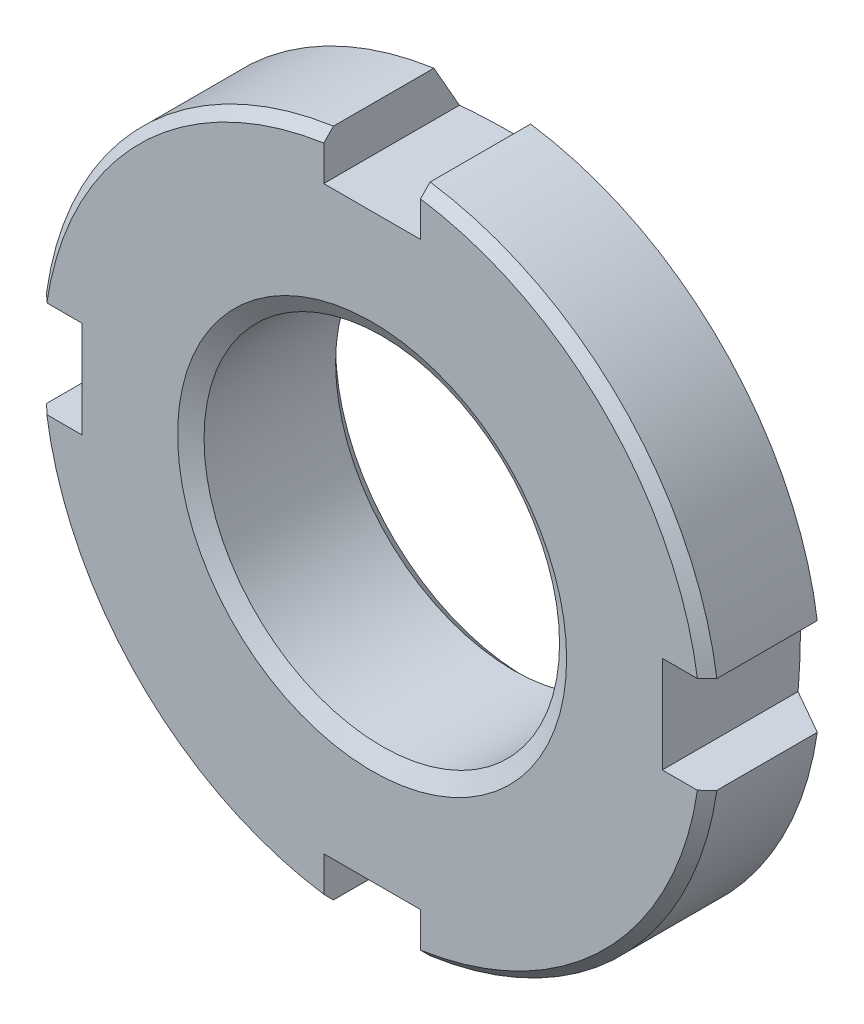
ISO-10303-21;
HEADER;
FILE_DESCRIPTION(('STEP AP214'),'2;1');
FILE_NAME('part.step','',(''),(''),'','','');
FILE_SCHEMA(('AUTOMOTIVE_DESIGN { 1 0 10303 214 1 1 1 1 }'));
ENDSEC;
DATA;
#1=APPLICATION_CONTEXT('core data for automotive mechanical design processes');
#2=APPLICATION_PROTOCOL_DEFINITION('international standard','automotive_design',2000,#1);
#3=PRODUCT_CONTEXT('',#1,'mechanical');
#4=PRODUCT('Part','Part','',(#3));
#5=PRODUCT_RELATED_PRODUCT_CATEGORY('part','',(#4));
#6=PRODUCT_DEFINITION_FORMATION('','',#4);
#7=PRODUCT_DEFINITION_CONTEXT('part definition',#1,'design');
#8=PRODUCT_DEFINITION('design','',#6,#7);
#9=PRODUCT_DEFINITION_SHAPE('','',#8);
#10=(LENGTH_UNIT() NAMED_UNIT(*) SI_UNIT(.MILLI.,.METRE.));
#11=(NAMED_UNIT(*) PLANE_ANGLE_UNIT() SI_UNIT($,.RADIAN.));
#12=(NAMED_UNIT(*) SI_UNIT($,.STERADIAN.) SOLID_ANGLE_UNIT());
#13=UNCERTAINTY_MEASURE_WITH_UNIT(LENGTH_MEASURE(1.E-05),#10,'distance_accuracy_value','');
#14=(GEOMETRIC_REPRESENTATION_CONTEXT(3) GLOBAL_UNCERTAINTY_ASSIGNED_CONTEXT((#13)) GLOBAL_UNIT_ASSIGNED_CONTEXT((#10,
#11,#12)) REPRESENTATION_CONTEXT('',''));
#15=CARTESIAN_POINT('',(0.,0.,0.));
#16=DIRECTION('',(0.,0.,1.));
#17=DIRECTION('',(1.,0.,0.));
#18=AXIS2_PLACEMENT_3D('',#15,#16,#17);
#19=CARTESIAN_POINT('',(0.,0.,-8.));
#20=DIRECTION('',(0.,0.,1.));
#21=DIRECTION('',(1.,0.,0.));
#22=AXIS2_PLACEMENT_3D('',#19,#20,#21);
#23=CYLINDRICAL_SURFACE('',#22,17.5);
#24=DIRECTION('',(0.,0.,-1.));
#25=VECTOR('',#24,1.);
#26=CARTESIAN_POINT('',(-17.3205080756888,-2.50000000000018,0.));
#27=LINE('',#26,#25);
#28=CARTESIAN_POINT('',(-17.3205080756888,-2.50000000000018,-0.500000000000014));
#29=VERTEX_POINT('',#28);
#30=CARTESIAN_POINT('',(-17.3205080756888,-2.50000000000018,-5.69059892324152));
#31=VERTEX_POINT('',#30);
#32=EDGE_CURVE('E188',#29,#31,#27,.T.);
#33=ORIENTED_EDGE('',*,*,#32,.T.);
#34=CARTESIAN_POINT('',(0.,0.,-5.69059892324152));
#35=DIRECTION('',(0.,0.,-1.));
#36=DIRECTION('',(-1.,0.,0.));
#37=AXIS2_PLACEMENT_3D('',#34,#35,#36);
#38=CIRCLE('',#37,17.5);
#39=CARTESIAN_POINT('',(-2.5,-17.3205080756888,-5.69059892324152));
#40=VERTEX_POINT('',#39);
#41=EDGE_CURVE('E454',#40,#31,#38,.T.);
#42=ORIENTED_EDGE('',*,*,#41,.F.);
#43=DIRECTION('',(0.,0.,-1.));
#44=VECTOR('',#43,1.);
#45=CARTESIAN_POINT('',(-2.5,-17.3205080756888,0.));
#46=LINE('',#45,#44);
#47=CARTESIAN_POINT('',(-2.5,-17.3205080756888,-0.500000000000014));
#48=VERTEX_POINT('',#47);
#49=EDGE_CURVE('E434',#48,#40,#46,.T.);
#50=ORIENTED_EDGE('',*,*,#49,.F.);
#51=CARTESIAN_POINT('',(0.,0.,-0.500000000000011));
#52=DIRECTION('',(0.,0.,1.));
#53=DIRECTION('',(1.,0.,0.));
#54=AXIS2_PLACEMENT_3D('',#51,#52,#53);
#55=CIRCLE('',#54,17.5);
#56=EDGE_CURVE('E489',#48,#29,#55,.F.);
#57=ORIENTED_EDGE('',*,*,#56,.T.);
#58=EDGE_LOOP('',(#33,#42,#50,#57));
#59=FACE_BOUND('',#58,.T.);
#60=ADVANCED_FACE('F30',(#59),#23,.T.);
#61=CARTESIAN_POINT('',(0.,0.,0.));
#62=DIRECTION('',(0.,0.,-1.));
#63=DIRECTION('',(-1.,0.,0.));
#64=AXIS2_PLACEMENT_3D('',#61,#62,#63);
#65=CONICAL_SURFACE('',#64,17.,0.785398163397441);
#66=CARTESIAN_POINT('',(-20.2012542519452,-2.50000000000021,-3.35535981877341));
#67=CARTESIAN_POINT('',(-19.6762296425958,-2.50000000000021,-2.83431955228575));
#68=CARTESIAN_POINT('',(-19.1510612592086,-2.5000000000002,-2.31342403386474));
#69=CARTESIAN_POINT('',(-18.1003324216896,-2.50000000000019,-1.2720296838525));
#70=CARTESIAN_POINT('',(-17.5747719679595,-2.50000000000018,-0.751530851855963));
#71=CARTESIAN_POINT('',(-16.5231531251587,-2.50000000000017,0.288964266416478));
#72=CARTESIAN_POINT('',(-15.9970947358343,-2.50000000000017,0.808960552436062));
#73=CARTESIAN_POINT('',(-14.9442956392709,-2.50000000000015,1.8482629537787));
#74=CARTESIAN_POINT('',(-14.417554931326,-2.50000000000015,2.36756906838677));
#75=CARTESIAN_POINT('',(-13.8903812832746,-2.50000000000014,2.88643587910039));
#76=B_SPLINE_CURVE_WITH_KNOTS('',3,(#66,#67,#68,#69,#70,#71,#72,#73,#74,#75),.UNSPECIFIED.,.F.,
.F.,(4,2,2,2,4),(0.,2.21905488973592,4.43810750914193,6.6571612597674,8.87621730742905),.UNSPECIFIED.);
#77=CARTESIAN_POINT('',(-16.8151717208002,-2.50000000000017,0.));
#78=VERTEX_POINT('',#77);
#79=EDGE_CURVE('E211',#29,#78,#76,.T.);
#80=ORIENTED_EDGE('',*,*,#79,.F.);
#81=ORIENTED_EDGE('',*,*,#56,.F.);
#82=CARTESIAN_POINT('',(-2.5,-13.8903812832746,2.8864358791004));
#83=CARTESIAN_POINT('',(-2.5,-14.4175549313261,2.36756906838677));
#84=CARTESIAN_POINT('',(-2.5,-14.9442956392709,1.8482629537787));
#85=CARTESIAN_POINT('',(-2.5,-15.9970947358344,0.808960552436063));
#86=CARTESIAN_POINT('',(-2.5,-16.5231531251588,0.288964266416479));
#87=CARTESIAN_POINT('',(-2.5,-17.5747719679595,-0.751530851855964));
#88=CARTESIAN_POINT('',(-2.5,-18.1003324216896,-1.2720296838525));
#89=CARTESIAN_POINT('',(-2.5,-19.1510612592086,-2.31342403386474));
#90=CARTESIAN_POINT('',(-2.5,-19.6762296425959,-2.83431955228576));
#91=CARTESIAN_POINT('',(-2.5,-20.2012542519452,-3.35535981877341));
#92=B_SPLINE_CURVE_WITH_KNOTS('',3,(#82,#83,#84,#85,#86,#87,#88,#89,#90,#91),.UNSPECIFIED.,.F.,
.F.,(4,2,2,2,4),(0.,2.21905604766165,4.43810979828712,6.65716241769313,8.87621730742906),.UNSPECIFIED.);
#93=CARTESIAN_POINT('',(-2.5,-16.8151717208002,0.));
#94=VERTEX_POINT('',#93);
#95=EDGE_CURVE('E402',#94,#48,#92,.T.);
#96=ORIENTED_EDGE('',*,*,#95,.F.);
#97=CARTESIAN_POINT('',(0.,0.,0.));
#98=DIRECTION('',(0.,0.,1.));
#99=DIRECTION('',(1.,0.,0.));
#100=AXIS2_PLACEMENT_3D('',#97,#98,#99);
#101=CIRCLE('',#100,17.);
#102=EDGE_CURVE('E459',#78,#94,#101,.T.);
#103=ORIENTED_EDGE('',*,*,#102,.F.);
#104=EDGE_LOOP('',(#80,#81,#96,#103));
#105=FACE_BOUND('',#104,.T.);
#106=ADVANCED_FACE('F514',(#105),#65,.T.);
#107=DIRECTION('',(0.,0.,-1.));
#108=VECTOR('',#107,1.);
#109=CARTESIAN_POINT('',(-17.3205080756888,2.49999999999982,0.));
#110=LINE('',#109,#108);
#111=CARTESIAN_POINT('',(-17.3205080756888,2.49999999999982,-0.500000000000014));
#112=VERTEX_POINT('',#111);
#113=CARTESIAN_POINT('',(-17.3205080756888,2.49999999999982,-5.69059892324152));
#114=VERTEX_POINT('',#113);
#115=EDGE_CURVE('E50',#112,#114,#110,.T.);
#116=ORIENTED_EDGE('',*,*,#115,.F.);
#117=CARTESIAN_POINT('',(-2.50000000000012,17.3205080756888,-0.500000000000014));
#118=VERTEX_POINT('',#117);
#119=EDGE_CURVE('E472',#112,#118,#55,.F.);
#120=ORIENTED_EDGE('',*,*,#119,.T.);
#121=DIRECTION('',(0.,0.,-1.));
#122=VECTOR('',#121,1.);
#123=CARTESIAN_POINT('',(-2.50000000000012,17.3205080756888,0.));
#124=LINE('',#123,#122);
#125=CARTESIAN_POINT('',(-2.50000000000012,17.3205080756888,-5.69059892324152));
#126=VERTEX_POINT('',#125);
#127=EDGE_CURVE('E334',#118,#126,#124,.T.);
#128=ORIENTED_EDGE('',*,*,#127,.T.);
#129=EDGE_CURVE('E455',#114,#126,#38,.T.);
#130=ORIENTED_EDGE('',*,*,#129,.F.);
#131=EDGE_LOOP('',(#116,#120,#128,#130));
#132=FACE_BOUND('',#131,.T.);
#133=ADVANCED_FACE('F470',(#132),#23,.T.);
#134=CARTESIAN_POINT('',(-13.8903812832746,2.49999999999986,2.8864358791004));
#135=CARTESIAN_POINT('',(-14.4175549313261,2.49999999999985,2.36756906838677));
#136=CARTESIAN_POINT('',(-14.9442956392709,2.49999999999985,1.8482629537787));
#137=CARTESIAN_POINT('',(-15.9970947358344,2.49999999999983,0.808960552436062));
#138=CARTESIAN_POINT('',(-16.5231531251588,2.49999999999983,0.288964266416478));
#139=CARTESIAN_POINT('',(-17.5747719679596,2.49999999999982,-0.751530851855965));
#140=CARTESIAN_POINT('',(-18.1003324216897,2.49999999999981,-1.2720296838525));
#141=CARTESIAN_POINT('',(-19.1510612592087,2.4999999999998,-2.31342403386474));
#142=CARTESIAN_POINT('',(-19.6762296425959,2.4999999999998,-2.83431955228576));
#143=CARTESIAN_POINT('',(-20.2012542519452,2.49999999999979,-3.35535981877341));
#144=B_SPLINE_CURVE_WITH_KNOTS('',3,(#134,#135,#136,#137,#138,#139,#140,#141,#142,#143),
.UNSPECIFIED.,.F.,.F.,(4,2,2,2,4),(0.,2.21905604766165,4.43810979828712,6.65716241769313,
8.87621730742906),.UNSPECIFIED.);
#145=CARTESIAN_POINT('',(-16.8151717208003,2.49999999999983,0.));
#146=VERTEX_POINT('',#145);
#147=EDGE_CURVE('E200',#146,#112,#144,.T.);
#148=ORIENTED_EDGE('',*,*,#147,.F.);
#149=CARTESIAN_POINT('',(-2.50000000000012,16.8151717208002,0.));
#150=VERTEX_POINT('',#149);
#151=EDGE_CURVE('E195',#150,#146,#101,.T.);
#152=ORIENTED_EDGE('',*,*,#151,.F.);
#153=CARTESIAN_POINT('',(-2.50000000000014,20.2012542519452,-3.35535981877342));
#154=CARTESIAN_POINT('',(-2.50000000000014,19.6762296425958,-2.83431955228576));
#155=CARTESIAN_POINT('',(-2.50000000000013,19.1510612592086,-2.31342403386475));
#156=CARTESIAN_POINT('',(-2.50000000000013,18.1003324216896,-1.2720296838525));
#157=CARTESIAN_POINT('',(-2.50000000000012,17.5747719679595,-0.751530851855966));
#158=CARTESIAN_POINT('',(-2.50000000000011,16.5231531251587,0.288964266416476));
#159=CARTESIAN_POINT('',(-2.50000000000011,15.9970947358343,0.80896055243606));
#160=CARTESIAN_POINT('',(-2.5000000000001,14.9442956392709,1.8482629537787));
#161=CARTESIAN_POINT('',(-2.5000000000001,14.417554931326,2.36756906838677));
#162=CARTESIAN_POINT('',(-2.5000000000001,13.8903812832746,2.88643587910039));
#163=B_SPLINE_CURVE_WITH_KNOTS('',3,(#153,#154,#155,#156,#157,#158,#159,#160,#161,#162),
.UNSPECIFIED.,.F.,.F.,(4,2,2,2,4),(0.,2.21905488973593,4.43810750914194,6.65716125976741,
8.87621730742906),.UNSPECIFIED.);
#164=EDGE_CURVE('E332',#118,#150,#163,.T.);
#165=ORIENTED_EDGE('',*,*,#164,.F.);
#166=ORIENTED_EDGE('',*,*,#119,.F.);
#167=EDGE_LOOP('',(#148,#152,#165,#166));
#168=FACE_BOUND('',#167,.T.);
#169=ADVANCED_FACE('F520',(#168),#65,.T.);
#170=DIRECTION('',(0.,0.,-1.));
#171=VECTOR('',#170,1.);
#172=CARTESIAN_POINT('',(2.49999999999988,17.3205080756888,0.));
#173=LINE('',#172,#171);
#174=CARTESIAN_POINT('',(2.49999999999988,17.3205080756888,-0.500000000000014));
#175=VERTEX_POINT('',#174);
#176=CARTESIAN_POINT('',(2.49999999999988,17.3205080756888,-5.69059892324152));
#177=VERTEX_POINT('',#176);
#178=EDGE_CURVE('E58',#175,#177,#173,.T.);
#179=ORIENTED_EDGE('',*,*,#178,.F.);
#180=CARTESIAN_POINT('',(17.3205080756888,2.50000000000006,-0.500000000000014));
#181=VERTEX_POINT('',#180);
#182=EDGE_CURVE('E364',#175,#181,#55,.F.);
#183=ORIENTED_EDGE('',*,*,#182,.T.);
#184=DIRECTION('',(0.,0.,-1.));
#185=VECTOR('',#184,1.);
#186=CARTESIAN_POINT('',(17.3205080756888,2.50000000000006,0.));
#187=LINE('',#186,#185);
#188=CARTESIAN_POINT('',(17.3205080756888,2.50000000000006,-5.69059892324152));
#189=VERTEX_POINT('',#188);
#190=EDGE_CURVE('E349',#181,#189,#187,.T.);
#191=ORIENTED_EDGE('',*,*,#190,.T.);
#192=EDGE_CURVE('E362',#177,#189,#38,.T.);
#193=ORIENTED_EDGE('',*,*,#192,.F.);
#194=EDGE_LOOP('',(#179,#183,#191,#193));
#195=FACE_BOUND('',#194,.T.);
#196=ADVANCED_FACE('F361',(#195),#23,.T.);
#197=CARTESIAN_POINT('',(2.4999999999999,13.8903812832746,2.8864358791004));
#198=CARTESIAN_POINT('',(2.4999999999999,14.4175549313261,2.36756906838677));
#199=CARTESIAN_POINT('',(2.4999999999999,14.9442956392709,1.8482629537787));
#200=CARTESIAN_POINT('',(2.49999999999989,15.9970947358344,0.808960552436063));
#201=CARTESIAN_POINT('',(2.49999999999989,16.5231531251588,0.288964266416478));
#202=CARTESIAN_POINT('',(2.49999999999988,17.5747719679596,-0.751530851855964));
#203=CARTESIAN_POINT('',(2.49999999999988,18.1003324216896,-1.2720296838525));
#204=CARTESIAN_POINT('',(2.49999999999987,19.1510612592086,-2.31342403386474));
#205=CARTESIAN_POINT('',(2.49999999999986,19.6762296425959,-2.83431955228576));
#206=CARTESIAN_POINT('',(2.49999999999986,20.2012542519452,-3.35535981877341));
#207=B_SPLINE_CURVE_WITH_KNOTS('',3,(#197,#198,#199,#200,#201,#202,#203,#204,#205,#206),
.UNSPECIFIED.,.F.,.F.,(4,2,2,2,4),(0.,2.21905604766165,4.43810979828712,6.65716241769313,
8.87621730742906),.UNSPECIFIED.);
#208=CARTESIAN_POINT('',(2.49999999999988,16.8151717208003,0.));
#209=VERTEX_POINT('',#208);
#210=EDGE_CURVE('E326',#209,#175,#207,.T.);
#211=ORIENTED_EDGE('',*,*,#210,.F.);
#212=CARTESIAN_POINT('',(16.8151717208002,2.50000000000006,0.));
#213=VERTEX_POINT('',#212);
#214=EDGE_CURVE('E377',#213,#209,#101,.T.);
#215=ORIENTED_EDGE('',*,*,#214,.F.);
#216=CARTESIAN_POINT('',(20.2012542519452,2.50000000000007,-3.35535981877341));
#217=CARTESIAN_POINT('',(19.6762296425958,2.50000000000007,-2.83431955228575));
#218=CARTESIAN_POINT('',(19.1510612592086,2.50000000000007,-2.31342403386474));
#219=CARTESIAN_POINT('',(18.1003324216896,2.50000000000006,-1.2720296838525));
#220=CARTESIAN_POINT('',(17.5747719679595,2.50000000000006,-0.751530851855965));
#221=CARTESIAN_POINT('',(16.5231531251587,2.50000000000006,0.288964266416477));
#222=CARTESIAN_POINT('',(15.9970947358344,2.50000000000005,0.80896055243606));
#223=CARTESIAN_POINT('',(14.9442956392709,2.50000000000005,1.8482629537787));
#224=CARTESIAN_POINT('',(14.4175549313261,2.50000000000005,2.36756906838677));
#225=CARTESIAN_POINT('',(13.8903812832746,2.50000000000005,2.88643587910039));
#226=B_SPLINE_CURVE_WITH_KNOTS('',3,(#216,#217,#218,#219,#220,#221,#222,#223,#224,#225),
.UNSPECIFIED.,.F.,.F.,(4,2,2,2,4),(0.,2.21905488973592,4.43810750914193,6.65716125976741,
8.87621730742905),.UNSPECIFIED.);
#227=EDGE_CURVE('E370',#181,#213,#226,.T.);
#228=ORIENTED_EDGE('',*,*,#227,.F.);
#229=ORIENTED_EDGE('',*,*,#182,.F.);
#230=EDGE_LOOP('',(#211,#215,#228,#229));
#231=FACE_BOUND('',#230,.T.);
#232=ADVANCED_FACE('F375',(#231),#65,.T.);
#233=DIRECTION('',(0.,0.,-1.));
#234=VECTOR('',#233,1.);
#235=CARTESIAN_POINT('',(17.3205080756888,-2.49999999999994,0.));
#236=LINE('',#235,#234);
#237=CARTESIAN_POINT('',(17.3205080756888,-2.49999999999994,-0.500000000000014));
#238=VERTEX_POINT('',#237);
#239=CARTESIAN_POINT('',(17.3205080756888,-2.49999999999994,-5.69059892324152));
#240=VERTEX_POINT('',#239);
#241=EDGE_CURVE('E356',#238,#240,#236,.T.);
#242=ORIENTED_EDGE('',*,*,#241,.F.);
#243=CARTESIAN_POINT('',(2.5,-17.3205080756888,-0.500000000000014));
#244=VERTEX_POINT('',#243);
#245=EDGE_CURVE('E487',#238,#244,#55,.F.);
#246=ORIENTED_EDGE('',*,*,#245,.T.);
#247=DIRECTION('',(0.,0.,-1.));
#248=VECTOR('',#247,1.);
#249=CARTESIAN_POINT('',(2.5,-17.3205080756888,0.));
#250=LINE('',#249,#248);
#251=CARTESIAN_POINT('',(2.5,-17.3205080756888,-5.69059892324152));
#252=VERTEX_POINT('',#251);
#253=EDGE_CURVE('E440',#244,#252,#250,.T.);
#254=ORIENTED_EDGE('',*,*,#253,.T.);
#255=EDGE_CURVE('E449',#240,#252,#38,.T.);
#256=ORIENTED_EDGE('',*,*,#255,.F.);
#257=EDGE_LOOP('',(#242,#246,#254,#256));
#258=FACE_BOUND('',#257,.T.);
#259=ADVANCED_FACE('F452',(#258),#23,.T.);
#260=CARTESIAN_POINT('',(0.,0.,-8.));
#261=DIRECTION('',(0.,0.,1.));
#262=DIRECTION('',(1.,0.,0.));
#263=AXIS2_PLACEMENT_3D('',#260,#261,#262);
#264=PLANE('',#263);
#265=CARTESIAN_POINT('',(0.,0.,-8.));
#266=DIRECTION('',(0.,0.,1.));
#267=DIRECTION('',(1.,0.,0.));
#268=AXIS2_PLACEMENT_3D('',#265,#266,#267);
#269=CIRCLE('',#268,9.888);
#270=CARTESIAN_POINT('',(9.888,0.,-8.));
#271=VERTEX_POINT('',#270);
#272=EDGE_CURVE('E497',#271,#271,#269,.T.);
#273=ORIENTED_EDGE('',*,*,#272,.T.);
#274=EDGE_LOOP('',(#273));
#275=FACE_BOUND('',#274,.T.);
#276=CARTESIAN_POINT('',(0.,0.,-8.));
#277=DIRECTION('',(0.,0.,-1.));
#278=DIRECTION('',(-1.,0.,0.));
#279=AXIS2_PLACEMENT_3D('',#276,#277,#278);
#280=CIRCLE('',#279,13.5);
#281=CARTESIAN_POINT('',(-13.5,0.,-8.));
#282=VERTEX_POINT('',#281);
#283=EDGE_CURVE('E457',#282,#282,#280,.T.);
#284=ORIENTED_EDGE('',*,*,#283,.T.);
#285=EDGE_LOOP('',(#284));
#286=FACE_BOUND('',#285,.T.);
#287=ADVANCED_FACE('F524',(#275,#286),#264,.F.);
#288=CARTESIAN_POINT('',(0.,0.,0.));
#289=DIRECTION('',(0.,0.,1.));
#290=DIRECTION('',(1.,0.,0.));
#291=AXIS2_PLACEMENT_3D('',#288,#289,#290);
#292=PLANE('',#291);
#293=DIRECTION('',(-1.,0.,0.));
#294=VECTOR('',#293,1.);
#295=CARTESIAN_POINT('',(-17.3205080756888,-2.50000000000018,0.));
#296=LINE('',#295,#294);
#297=CARTESIAN_POINT('',(-15.,-2.50000000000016,0.));
#298=VERTEX_POINT('',#297);
#299=EDGE_CURVE('E196',#298,#78,#296,.T.);
#300=ORIENTED_EDGE('',*,*,#299,.T.);
#301=ORIENTED_EDGE('',*,*,#102,.T.);
#302=DIRECTION('',(0.,1.,0.));
#303=VECTOR('',#302,1.);
#304=CARTESIAN_POINT('',(-2.5,-15.,0.));
#305=LINE('',#304,#303);
#306=CARTESIAN_POINT('',(-2.5,-15.,0.));
#307=VERTEX_POINT('',#306);
#308=EDGE_CURVE('E443',#94,#307,#305,.T.);
#309=ORIENTED_EDGE('',*,*,#308,.T.);
#310=DIRECTION('',(1.,0.,0.));
#311=VECTOR('',#310,1.);
#312=CARTESIAN_POINT('',(2.5,-15.,0.));
#313=LINE('',#312,#311);
#314=CARTESIAN_POINT('',(2.5,-15.,0.));
#315=VERTEX_POINT('',#314);
#316=EDGE_CURVE('E437',#307,#315,#313,.T.);
#317=ORIENTED_EDGE('',*,*,#316,.T.);
#318=DIRECTION('',(0.,-1.,0.));
#319=VECTOR('',#318,1.);
#320=CARTESIAN_POINT('',(2.5,-17.3205080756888,0.));
#321=LINE('',#320,#319);
#322=CARTESIAN_POINT('',(2.5,-16.8151717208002,0.));
#323=VERTEX_POINT('',#322);
#324=EDGE_CURVE('E431',#315,#323,#321,.T.);
#325=ORIENTED_EDGE('',*,*,#324,.T.);
#326=CARTESIAN_POINT('',(16.8151717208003,-2.49999999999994,0.));
#327=VERTEX_POINT('',#326);
#328=EDGE_CURVE('E485',#323,#327,#101,.T.);
#329=ORIENTED_EDGE('',*,*,#328,.T.);
#330=DIRECTION('',(-1.,0.,0.));
#331=VECTOR('',#330,1.);
#332=CARTESIAN_POINT('',(15.,-2.49999999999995,0.));
#333=LINE('',#332,#331);
#334=CARTESIAN_POINT('',(15.,-2.49999999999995,0.));
#335=VERTEX_POINT('',#334);
#336=EDGE_CURVE('E343',#327,#335,#333,.T.);
#337=ORIENTED_EDGE('',*,*,#336,.T.);
#338=DIRECTION('',(0.,1.,0.));
#339=VECTOR('',#338,1.);
#340=CARTESIAN_POINT('',(15.,2.50000000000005,0.));
#341=LINE('',#340,#339);
#342=CARTESIAN_POINT('',(15.,2.50000000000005,0.));
#343=VERTEX_POINT('',#342);
#344=EDGE_CURVE('E346',#335,#343,#341,.T.);
#345=ORIENTED_EDGE('',*,*,#344,.T.);
#346=DIRECTION('',(1.,0.,0.));
#347=VECTOR('',#346,1.);
#348=CARTESIAN_POINT('',(17.3205080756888,2.50000000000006,0.));
#349=LINE('',#348,#347);
#350=EDGE_CURVE('E340',#343,#213,#349,.T.);
#351=ORIENTED_EDGE('',*,*,#350,.T.);
#352=ORIENTED_EDGE('',*,*,#214,.T.);
#353=DIRECTION('',(0.,-1.,0.));
#354=VECTOR('',#353,1.);
#355=CARTESIAN_POINT('',(2.4999999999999,15.,0.));
#356=LINE('',#355,#354);
#357=CARTESIAN_POINT('',(2.4999999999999,15.,0.));
#358=VERTEX_POINT('',#357);
#359=EDGE_CURVE('E476',#209,#358,#356,.T.);
#360=ORIENTED_EDGE('',*,*,#359,.T.);
#361=DIRECTION('',(-1.,0.,0.));
#362=VECTOR('',#361,1.);
#363=CARTESIAN_POINT('',(-2.5000000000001,15.,0.));
#364=LINE('',#363,#362);
#365=CARTESIAN_POINT('',(-2.5000000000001,15.,0.));
#366=VERTEX_POINT('',#365);
#367=EDGE_CURVE('E473',#358,#366,#364,.T.);
#368=ORIENTED_EDGE('',*,*,#367,.T.);
#369=DIRECTION('',(0.,1.,0.));
#370=VECTOR('',#369,1.);
#371=CARTESIAN_POINT('',(-2.50000000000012,17.3205080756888,0.));
#372=LINE('',#371,#370);
#373=EDGE_CURVE('E480',#366,#150,#372,.T.);
#374=ORIENTED_EDGE('',*,*,#373,.T.);
#375=ORIENTED_EDGE('',*,*,#151,.T.);
#376=DIRECTION('',(1.,0.,0.));
#377=VECTOR('',#376,1.);
#378=CARTESIAN_POINT('',(-15.,2.49999999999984,0.));
#379=LINE('',#378,#377);
#380=CARTESIAN_POINT('',(-15.,2.49999999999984,0.));
#381=VERTEX_POINT('',#380);
#382=EDGE_CURVE('E174',#146,#381,#379,.T.);
#383=ORIENTED_EDGE('',*,*,#382,.T.);
#384=DIRECTION('',(0.,-1.,0.));
#385=VECTOR('',#384,1.);
#386=CARTESIAN_POINT('',(-15.,-2.50000000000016,0.));
#387=LINE('',#386,#385);
#388=EDGE_CURVE('E182',#381,#298,#387,.T.);
#389=ORIENTED_EDGE('',*,*,#388,.T.);
#390=EDGE_LOOP('',(#300,#301,#309,#317,#325,#329,#337,#345,#351,#352,#360,#368,#374,#375,#383,#389));
#391=FACE_BOUND('',#390,.T.);
#392=CARTESIAN_POINT('',(0.,0.,0.));
#393=DIRECTION('',(0.,0.,1.));
#394=DIRECTION('',(1.,0.,0.));
#395=AXIS2_PLACEMENT_3D('',#392,#393,#394);
#396=CIRCLE('',#395,10.0540254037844);
#397=CARTESIAN_POINT('',(10.0540254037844,0.,0.));
#398=VERTEX_POINT('',#397);
#399=EDGE_CURVE('E495',#398,#398,#396,.F.);
#400=ORIENTED_EDGE('',*,*,#399,.T.);
#401=EDGE_LOOP('',(#400));
#402=FACE_BOUND('',#401,.T.);
#403=ADVANCED_FACE('F191',(#391,#402),#292,.T.);
#404=CARTESIAN_POINT('',(0.,0.,-8.));
#405=DIRECTION('',(0.,0.,1.));
#406=DIRECTION('',(1.,0.,0.));
#407=AXIS2_PLACEMENT_3D('',#404,#405,#406);
#408=CYLINDRICAL_SURFACE('',#407,9.188);
#409=CARTESIAN_POINT('',(0.,0.,-7.3));
#410=DIRECTION('',(0.,0.,1.));
#411=DIRECTION('',(1.,0.,0.));
#412=AXIS2_PLACEMENT_3D('',#409,#410,#411);
#413=CIRCLE('',#412,9.188);
#414=CARTESIAN_POINT('',(9.188,0.,-7.3));
#415=VERTEX_POINT('',#414);
#416=EDGE_CURVE('E408',#415,#415,#413,.F.);
#417=ORIENTED_EDGE('',*,*,#416,.T.);
#418=EDGE_LOOP('',(#417));
#419=FACE_BOUND('',#418,.T.);
#420=CARTESIAN_POINT('',(0.,0.,-0.499999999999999));
#421=DIRECTION('',(0.,0.,1.));
#422=DIRECTION('',(1.,0.,0.));
#423=AXIS2_PLACEMENT_3D('',#420,#421,#422);
#424=CIRCLE('',#423,9.188);
#425=CARTESIAN_POINT('',(9.188,0.,-0.499999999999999));
#426=VERTEX_POINT('',#425);
#427=EDGE_CURVE('E492',#426,#426,#424,.T.);
#428=ORIENTED_EDGE('',*,*,#427,.T.);
#429=EDGE_LOOP('',(#428));
#430=FACE_BOUND('',#429,.T.);
#431=ADVANCED_FACE('F246',(#419,#430),#408,.F.);
#432=CARTESIAN_POINT('',(0.,0.,-5.69059892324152));
#433=DIRECTION('',(0.,0.,1.));
#434=DIRECTION('',(1.,0.,0.));
#435=AXIS2_PLACEMENT_3D('',#432,#433,#434);
#436=CONICAL_SURFACE('',#435,17.5,1.0471975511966);
#437=ORIENTED_EDGE('',*,*,#283,.F.);
#438=EDGE_LOOP('',(#437));
#439=FACE_BOUND('',#438,.T.);
#440=ORIENTED_EDGE('',*,*,#41,.T.);
#441=CARTESIAN_POINT('',(-22.0968682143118,-2.50000000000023,-2.95520498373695));
#442=CARTESIAN_POINT('',(-21.2440212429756,-2.50000000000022,-3.44443582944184));
#443=CARTESIAN_POINT('',(-20.3910506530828,-2.50000000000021,-3.93345209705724));
#444=CARTESIAN_POINT('',(-18.684659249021,-2.50000000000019,-4.9106937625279));
#445=CARTESIAN_POINT('',(-17.8312384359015,-2.50000000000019,-5.39891916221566));
#446=CARTESIAN_POINT('',(-16.550613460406,-2.50000000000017,-6.13039503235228));
#447=CARTESIAN_POINT('',(-16.1236557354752,-2.50000000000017,-6.37407686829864));
#448=CARTESIAN_POINT('',(-15.2695289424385,-2.50000000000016,-6.8610696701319));
#449=CARTESIAN_POINT('',(-14.8423598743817,-2.50000000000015,-7.10438063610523));
#450=CARTESIAN_POINT('',(-13.9877533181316,-2.50000000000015,-7.5905332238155));
#451=CARTESIAN_POINT('',(-13.5603158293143,-2.50000000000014,-7.83337484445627));
#452=CARTESIAN_POINT('',(-12.7050817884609,-2.50000000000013,-8.31842570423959));
#453=CARTESIAN_POINT('',(-12.2772852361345,-2.50000000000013,-8.56063494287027));
#454=CARTESIAN_POINT('',(-11.8492636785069,-2.50000000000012,-8.8024465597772));
#455=B_SPLINE_CURVE_WITH_KNOTS('',3,(#441,#442,#443,#444,#445,#446,#447,#448,#449,#450,#451,
#452,#453,#454),.UNSPECIFIED.,.F.,.F.,(4,2,2,2,2,2,4),(0.,2.94961983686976,5.89923282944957,
7.37404236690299,8.84885156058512,10.3236641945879,11.7984780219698),.UNSPECIFIED.);
#456=CARTESIAN_POINT('',(-15.,-2.50000000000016,-7.01451717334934));
#457=VERTEX_POINT('',#456);
#458=EDGE_CURVE('E11',#31,#457,#455,.T.);
#459=ORIENTED_EDGE('',*,*,#458,.T.);
#460=CARTESIAN_POINT('',(-14.9999999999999,-12.683556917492,-4.45296744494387));
#461=CARTESIAN_POINT('',(-14.9999999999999,-12.2418116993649,-4.61759858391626));
#462=CARTESIAN_POINT('',(-14.9999999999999,-11.7984134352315,-4.77791730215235));
#463=CARTESIAN_POINT('',(-14.9999999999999,-10.9078648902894,-5.08823902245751));
#464=CARTESIAN_POINT('',(-14.9999999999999,-10.4607134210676,-5.23823860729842));
#465=CARTESIAN_POINT('',(-14.9999999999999,-9.56046979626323,-5.52677212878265));
#466=CARTESIAN_POINT('',(-14.9999999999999,-9.10735990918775,-5.66525107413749));
#467=CARTESIAN_POINT('',(-14.9999999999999,-8.19702220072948,-5.92785973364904));
#468=CARTESIAN_POINT('',(-14.9999999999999,-7.73979475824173,-6.05199075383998));
#469=CARTESIAN_POINT('',(-14.9999999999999,-6.83460591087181,-6.2801861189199));
#470=CARTESIAN_POINT('',(-14.9999999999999,-6.38676684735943,-6.3847328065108));
#471=CARTESIAN_POINT('',(-14.9999999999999,-5.48727745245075,-6.57585172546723));
#472=CARTESIAN_POINT('',(-15.,-5.03562743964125,-6.66242544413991));
#473=CARTESIAN_POINT('',(-15.,-4.12972216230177,-6.8152281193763));
#474=CARTESIAN_POINT('',(-15.,-3.67547317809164,-6.88149401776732));
#475=CARTESIAN_POINT('',(-15.,-2.76429884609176,-6.99189749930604));
#476=CARTESIAN_POINT('',(-15.,-2.30737376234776,-7.03603722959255));
#477=CARTESIAN_POINT('',(-15.,-1.51150030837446,-7.09227691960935));
#478=CARTESIAN_POINT('',(-15.,-1.17292369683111,-7.10973520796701));
#479=CARTESIAN_POINT('',(-15.,-0.495352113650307,-7.13145383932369));
#480=CARTESIAN_POINT('',(-15.,-0.156357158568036,-7.135714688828));
#481=CARTESIAN_POINT('',(-15.,0.521803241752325,-7.13094945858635));
#482=CARTESIAN_POINT('',(-15.,0.860968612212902,-7.12191295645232));
#483=CARTESIAN_POINT('',(-15.,1.53868972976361,-7.09071473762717));
#484=CARTESIAN_POINT('',(-15.,1.8772454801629,-7.06855309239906));
#485=CARTESIAN_POINT('',(-15.,2.56049951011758,-7.01092048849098));
#486=CARTESIAN_POINT('',(-15.,2.90517455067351,-6.97517538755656));
#487=CARTESIAN_POINT('',(-15.,3.59300359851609,-6.89110820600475));
#488=CARTESIAN_POINT('',(-15.,3.93615749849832,-6.84278525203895));
#489=CARTESIAN_POINT('',(-15.0000000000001,4.6202412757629,-6.73445366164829));
#490=CARTESIAN_POINT('',(-15.0000000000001,4.96117307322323,-6.674457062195));
#491=CARTESIAN_POINT('',(-15.0000000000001,5.64089391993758,-6.54369967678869));
#492=CARTESIAN_POINT('',(-15.0000000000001,5.97968341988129,-6.47294123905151));
#493=CARTESIAN_POINT('',(-15.0000000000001,6.31733932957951,-6.39726500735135));
#494=B_SPLINE_CURVE_WITH_KNOTS('',3,(#460,#461,#462,#463,#464,#465,#466,#467,#468,#469,#470,
#471,#472,#473,#474,#475,#476,#477,#478,#479,#480,#481,#482,#483,#484,#485,#486,#487,#488,#489,
#490,#491,#492,#493),.UNSPECIFIED.,.F.,.F.,(4,2,2,2,2,2,2,2,2,2,2,2,2,2,2,2,4),(0.,
1.41431890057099,2.82910392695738,4.25029503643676,5.67135667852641,7.05067512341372,
8.42987938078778,9.80655963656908,11.183106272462,12.1999466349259,13.2167479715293,
14.234346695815,15.2519398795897,16.2912661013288,17.3306645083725,18.3689967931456,
19.4071028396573),.UNSPECIFIED.);
#495=CARTESIAN_POINT('',(-15.,2.49999999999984,-7.01451717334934));
#496=VERTEX_POINT('',#495);
#497=EDGE_CURVE('E43',#457,#496,#494,.T.);
#498=ORIENTED_EDGE('',*,*,#497,.T.);
#499=CARTESIAN_POINT('',(-11.849263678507,2.49999999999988,-8.8024465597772));
#500=CARTESIAN_POINT('',(-12.2772852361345,2.49999999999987,-8.56063494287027));
#501=CARTESIAN_POINT('',(-12.705081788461,2.49999999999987,-8.31842570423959));
#502=CARTESIAN_POINT('',(-13.5603158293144,2.49999999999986,-7.83337484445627));
#503=CARTESIAN_POINT('',(-13.9877533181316,2.49999999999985,-7.5905332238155));
#504=CARTESIAN_POINT('',(-14.8423598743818,2.49999999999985,-7.10438063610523));
#505=CARTESIAN_POINT('',(-15.2695289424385,2.49999999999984,-6.8610696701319));
#506=CARTESIAN_POINT('',(-16.1236557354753,2.49999999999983,-6.37407686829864));
#507=CARTESIAN_POINT('',(-16.550613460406,2.49999999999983,-6.13039503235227));
#508=CARTESIAN_POINT('',(-17.8312384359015,2.49999999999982,-5.39891916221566));
#509=CARTESIAN_POINT('',(-18.6846592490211,2.49999999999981,-4.9106937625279));
#510=CARTESIAN_POINT('',(-20.3910506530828,2.49999999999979,-3.93345209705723));
#511=CARTESIAN_POINT('',(-21.2440212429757,2.49999999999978,-3.44443582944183));
#512=CARTESIAN_POINT('',(-22.0968682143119,2.49999999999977,-2.95520498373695));
#513=B_SPLINE_CURVE_WITH_KNOTS('',3,(#499,#500,#501,#502,#503,#504,#505,#506,#507,#508,#509,
#510,#511,#512),.UNSPECIFIED.,.F.,.F.,(4,2,2,2,2,2,4),(0.,1.47481382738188,2.94962646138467,
4.4244356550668,5.89924519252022,8.84885818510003,11.7984780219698),.UNSPECIFIED.);
#514=EDGE_CURVE('E176',#496,#114,#513,.T.);
#515=ORIENTED_EDGE('',*,*,#514,.T.);
#516=ORIENTED_EDGE('',*,*,#129,.T.);
#517=CARTESIAN_POINT('',(-2.50000000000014,20.2892458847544,-3.9916371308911));
#518=CARTESIAN_POINT('',(-2.50000000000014,19.8627056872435,-4.23605088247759));
#519=CARTESIAN_POINT('',(-2.50000000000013,19.4361168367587,-4.48037968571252));
#520=CARTESIAN_POINT('',(-2.50000000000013,18.5828179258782,-4.96882585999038));
#521=CARTESIAN_POINT('',(-2.50000000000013,18.1561078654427,-5.21294323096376));
#522=CARTESIAN_POINT('',(-2.50000000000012,16.8757646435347,-5.9449132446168));
#523=CARTESIAN_POINT('',(-2.50000000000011,16.0219142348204,-6.43238619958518));
#524=CARTESIAN_POINT('',(-2.5000000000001,14.7404476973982,-7.16238754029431));
#525=CARTESIAN_POINT('',(-2.5000000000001,14.3131760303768,-7.40552053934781));
#526=CARTESIAN_POINT('',(-2.50000000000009,13.4583313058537,-7.89125562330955));
#527=CARTESIAN_POINT('',(-2.50000000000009,13.0307582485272,-8.13385770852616));
#528=CARTESIAN_POINT('',(-2.50000000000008,12.1752169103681,-8.618369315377));
#529=CARTESIAN_POINT('',(-2.50000000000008,11.7472486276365,-8.86027883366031));
#530=CARTESIAN_POINT('',(-2.50000000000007,10.890759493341,-9.34311945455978));
#531=CARTESIAN_POINT('',(-2.50000000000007,10.4622386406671,-9.58405055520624));
#532=CARTESIAN_POINT('',(-2.50000000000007,10.0333626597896,-9.8243496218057));
#533=B_SPLINE_CURVE_WITH_KNOTS('',3,(#517,#518,#519,#520,#521,#522,#523,#524,#525,#526,#527,
#528,#529,#530,#531,#532),.UNSPECIFIED.,.F.,.F.,(4,2,2,2,2,2,2,4),(0.,1.47481233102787,
2.94962514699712,5.89923623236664,7.37404867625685,8.84886026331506,10.32367897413,
11.7985006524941),.UNSPECIFIED.);
#534=CARTESIAN_POINT('',(-2.5000000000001,15.,-7.01451717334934));
#535=VERTEX_POINT('',#534);
#536=EDGE_CURVE('E232',#126,#535,#533,.T.);
#537=ORIENTED_EDGE('',*,*,#536,.T.);
#538=CARTESIAN_POINT('',(-12.6835569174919,14.9999999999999,-4.45296744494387));
#539=CARTESIAN_POINT('',(-12.2418116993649,14.9999999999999,-4.61759858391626));
#540=CARTESIAN_POINT('',(-11.7984134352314,14.9999999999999,-4.77791730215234));
#541=CARTESIAN_POINT('',(-10.9078648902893,14.9999999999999,-5.08823902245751));
#542=CARTESIAN_POINT('',(-10.4607134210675,14.9999999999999,-5.23823860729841));
#543=CARTESIAN_POINT('',(-9.56046979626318,14.9999999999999,-5.52677212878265));
#544=CARTESIAN_POINT('',(-9.1073599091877,14.9999999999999,-5.66525107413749));
#545=CARTESIAN_POINT('',(-8.19702220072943,14.9999999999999,-5.92785973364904));
#546=CARTESIAN_POINT('',(-7.73979475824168,15.,-6.05199075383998));
#547=CARTESIAN_POINT('',(-6.83460591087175,15.,-6.2801861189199));
#548=CARTESIAN_POINT('',(-6.38676684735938,15.,-6.3847328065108));
#549=CARTESIAN_POINT('',(-5.4872774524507,15.,-6.57585172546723));
#550=CARTESIAN_POINT('',(-5.03562743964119,15.,-6.66242544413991));
#551=CARTESIAN_POINT('',(-4.12972216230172,15.,-6.8152281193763));
#552=CARTESIAN_POINT('',(-3.67547317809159,15.,-6.88149401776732));
#553=CARTESIAN_POINT('',(-2.7642988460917,15.,-6.99189749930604));
#554=CARTESIAN_POINT('',(-2.30737376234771,15.,-7.03603722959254));
#555=CARTESIAN_POINT('',(-1.51150030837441,15.,-7.09227691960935));
#556=CARTESIAN_POINT('',(-1.17292369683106,15.,-7.10973520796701));
#557=CARTESIAN_POINT('',(-0.495352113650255,15.,-7.13145383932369));
#558=CARTESIAN_POINT('',(-0.156357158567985,15.,-7.135714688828));
#559=CARTESIAN_POINT('',(0.521803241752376,15.,-7.13094945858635));
#560=CARTESIAN_POINT('',(0.860968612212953,15.,-7.12191295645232));
#561=CARTESIAN_POINT('',(1.53868972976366,15.,-7.09071473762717));
#562=CARTESIAN_POINT('',(1.87724548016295,15.,-7.06855309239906));
#563=CARTESIAN_POINT('',(2.56049951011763,15.,-7.01092048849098));
#564=CARTESIAN_POINT('',(2.90517455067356,15.,-6.97517538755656));
#565=CARTESIAN_POINT('',(3.59300359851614,15.,-6.89110820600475));
#566=CARTESIAN_POINT('',(3.93615749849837,15.,-6.84278525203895));
#567=CARTESIAN_POINT('',(4.62024127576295,15.,-6.73445366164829));
#568=CARTESIAN_POINT('',(4.96117307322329,15.,-6.674457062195));
#569=CARTESIAN_POINT('',(5.64089391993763,15.,-6.54369967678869));
#570=CARTESIAN_POINT('',(5.97968341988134,15.,-6.47294123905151));
#571=CARTESIAN_POINT('',(6.31733932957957,15.,-6.39726500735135));
#572=B_SPLINE_CURVE_WITH_KNOTS('',3,(#538,#539,#540,#541,#542,#543,#544,#545,#546,#547,#548,
#549,#550,#551,#552,#553,#554,#555,#556,#557,#558,#559,#560,#561,#562,#563,#564,#565,#566,#567,
#568,#569,#570,#571),.UNSPECIFIED.,.F.,.F.,(4,2,2,2,2,2,2,2,2,2,2,2,2,2,2,2,4),(0.,
1.41431890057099,2.82910392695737,4.25029503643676,5.67135667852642,7.05067512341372,
8.42987938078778,9.80655963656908,11.183106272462,12.1999466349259,13.2167479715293,
14.234346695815,15.2519398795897,16.2912661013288,17.3306645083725,18.3689967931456,
19.4071028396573),.UNSPECIFIED.);
#573=CARTESIAN_POINT('',(2.4999999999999,15.,-7.01451717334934));
#574=VERTEX_POINT('',#573);
#575=EDGE_CURVE('E309',#535,#574,#572,.T.);
#576=ORIENTED_EDGE('',*,*,#575,.T.);
#577=CARTESIAN_POINT('',(2.49999999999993,10.0333626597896,-9.8243496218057));
#578=CARTESIAN_POINT('',(2.49999999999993,10.4622386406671,-9.58405055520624));
#579=CARTESIAN_POINT('',(2.49999999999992,10.8907594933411,-9.34311945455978));
#580=CARTESIAN_POINT('',(2.49999999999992,11.7472486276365,-8.86027883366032));
#581=CARTESIAN_POINT('',(2.49999999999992,12.1752169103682,-8.61836931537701));
#582=CARTESIAN_POINT('',(2.49999999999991,13.0307582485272,-8.13385770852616));
#583=CARTESIAN_POINT('',(2.49999999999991,13.4583313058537,-7.89125562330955));
#584=CARTESIAN_POINT('',(2.4999999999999,14.3131760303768,-7.40552053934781));
#585=CARTESIAN_POINT('',(2.4999999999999,14.7404476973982,-7.16238754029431));
#586=CARTESIAN_POINT('',(2.49999999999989,16.0219142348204,-6.43238619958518));
#587=CARTESIAN_POINT('',(2.49999999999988,16.8757646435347,-5.9449132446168));
#588=CARTESIAN_POINT('',(2.49999999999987,18.1561078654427,-5.21294323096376));
#589=CARTESIAN_POINT('',(2.49999999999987,18.5828179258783,-4.96882585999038));
#590=CARTESIAN_POINT('',(2.49999999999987,19.4361168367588,-4.48037968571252));
#591=CARTESIAN_POINT('',(2.49999999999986,19.8627056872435,-4.23605088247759));
#592=CARTESIAN_POINT('',(2.49999999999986,20.2892458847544,-3.9916371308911));
#593=B_SPLINE_CURVE_WITH_KNOTS('',3,(#577,#578,#579,#580,#581,#582,#583,#584,#585,#586,#587,
#588,#589,#590,#591,#592),.UNSPECIFIED.,.F.,.F.,(4,2,2,2,2,2,2,4),(0.,1.47482167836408,
2.94964038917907,4.42445197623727,5.89926442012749,8.848875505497,10.3236883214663,
11.7985006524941),.UNSPECIFIED.);
#594=EDGE_CURVE('E303',#574,#177,#593,.T.);
#595=ORIENTED_EDGE('',*,*,#594,.T.);
#596=ORIENTED_EDGE('',*,*,#192,.T.);
#597=CARTESIAN_POINT('',(20.2892458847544,2.50000000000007,-3.99163713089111));
#598=CARTESIAN_POINT('',(19.8627056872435,2.50000000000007,-4.23605088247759));
#599=CARTESIAN_POINT('',(19.4361168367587,2.50000000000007,-4.48037968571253));
#600=CARTESIAN_POINT('',(18.5828179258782,2.50000000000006,-4.96882585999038));
#601=CARTESIAN_POINT('',(18.1561078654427,2.50000000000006,-5.21294323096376));
#602=CARTESIAN_POINT('',(16.8757646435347,2.50000000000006,-5.9449132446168));
#603=CARTESIAN_POINT('',(16.0219142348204,2.50000000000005,-6.43238619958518));
#604=CARTESIAN_POINT('',(14.7404476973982,2.50000000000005,-7.16238754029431));
#605=CARTESIAN_POINT('',(14.3131760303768,2.50000000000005,-7.40552053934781));
#606=CARTESIAN_POINT('',(13.4583313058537,2.50000000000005,-7.89125562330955));
#607=CARTESIAN_POINT('',(13.0307582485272,2.50000000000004,-8.13385770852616));
#608=CARTESIAN_POINT('',(12.1752169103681,2.50000000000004,-8.618369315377));
#609=CARTESIAN_POINT('',(11.7472486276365,2.50000000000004,-8.86027883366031));
#610=CARTESIAN_POINT('',(10.8907594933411,2.50000000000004,-9.34311945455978));
#611=CARTESIAN_POINT('',(10.4622386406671,2.50000000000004,-9.58405055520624));
#612=CARTESIAN_POINT('',(10.0333626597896,2.50000000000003,-9.82434962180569));
#613=B_SPLINE_CURVE_WITH_KNOTS('',3,(#597,#598,#599,#600,#601,#602,#603,#604,#605,#606,#607,
#608,#609,#610,#611,#612),.UNSPECIFIED.,.F.,.F.,(4,2,2,2,2,2,2,4),(0.,1.47481233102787,
2.94962514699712,5.89923623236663,7.37404867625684,8.84886026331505,10.32367897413,
11.7985006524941),.UNSPECIFIED.);
#614=CARTESIAN_POINT('',(15.,2.50000000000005,-7.01451717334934));
#615=VERTEX_POINT('',#614);
#616=EDGE_CURVE('E287',#189,#615,#613,.T.);
#617=ORIENTED_EDGE('',*,*,#616,.T.);
#618=CARTESIAN_POINT('',(15.,6.31733932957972,-6.39726500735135));
#619=CARTESIAN_POINT('',(15.,5.97968341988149,-6.47294123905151));
#620=CARTESIAN_POINT('',(15.,5.64089391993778,-6.54369967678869));
#621=CARTESIAN_POINT('',(15.,4.96117307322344,-6.674457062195));
#622=CARTESIAN_POINT('',(15.,4.62024127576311,-6.73445366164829));
#623=CARTESIAN_POINT('',(15.,3.93615749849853,-6.84278525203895));
#624=CARTESIAN_POINT('',(15.,3.59300359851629,-6.89110820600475));
#625=CARTESIAN_POINT('',(15.,2.90517455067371,-6.97517538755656));
#626=CARTESIAN_POINT('',(15.,2.56049951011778,-7.01092048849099));
#627=CARTESIAN_POINT('',(15.,1.8772454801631,-7.06855309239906));
#628=CARTESIAN_POINT('',(15.,1.53868972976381,-7.09071473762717));
#629=CARTESIAN_POINT('',(15.,0.860968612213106,-7.12191295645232));
#630=CARTESIAN_POINT('',(15.,0.521803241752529,-7.13094945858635));
#631=CARTESIAN_POINT('',(15.,-0.156357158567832,-7.135714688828));
#632=CARTESIAN_POINT('',(15.,-0.495352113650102,-7.13145383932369));
#633=CARTESIAN_POINT('',(15.,-1.17292369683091,-7.10973520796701));
#634=CARTESIAN_POINT('',(15.,-1.51150030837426,-7.09227691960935));
#635=CARTESIAN_POINT('',(15.,-2.30737376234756,-7.03603722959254));
#636=CARTESIAN_POINT('',(15.,-2.76429884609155,-6.99189749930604));
#637=CARTESIAN_POINT('',(15.,-3.67547317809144,-6.88149401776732));
#638=CARTESIAN_POINT('',(15.,-4.12972216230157,-6.8152281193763));
#639=CARTESIAN_POINT('',(15.,-5.03562743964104,-6.66242544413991));
#640=CARTESIAN_POINT('',(15.,-5.48727745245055,-6.57585172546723));
#641=CARTESIAN_POINT('',(15.,-6.38676684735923,-6.3847328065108));
#642=CARTESIAN_POINT('',(15.,-6.8346059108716,-6.2801861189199));
#643=CARTESIAN_POINT('',(15.,-7.73979475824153,-6.05199075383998));
#644=CARTESIAN_POINT('',(15.,-8.19702220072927,-5.92785973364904));
#645=CARTESIAN_POINT('',(15.,-9.10735990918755,-5.66525107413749));
#646=CARTESIAN_POINT('',(15.,-9.56046979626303,-5.52677212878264));
#647=CARTESIAN_POINT('',(15.,-10.4607134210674,-5.23823860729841));
#648=CARTESIAN_POINT('',(15.,-10.9078648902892,-5.08823902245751));
#649=CARTESIAN_POINT('',(15.,-11.7984134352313,-4.77791730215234));
#650=CARTESIAN_POINT('',(15.,-12.2418116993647,-4.61759858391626));
#651=CARTESIAN_POINT('',(15.0000000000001,-12.6835569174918,-4.45296744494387));
#652=B_SPLINE_CURVE_WITH_KNOTS('',3,(#618,#619,#620,#621,#622,#623,#624,#625,#626,#627,#628,
#629,#630,#631,#632,#633,#634,#635,#636,#637,#638,#639,#640,#641,#642,#643,#644,#645,#646,#647,
#648,#649,#650,#651),.UNSPECIFIED.,.F.,.F.,(4,2,2,2,2,2,2,2,2,2,2,2,2,2,2,2,4),(0.,
1.03810604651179,2.07643833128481,3.11583673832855,4.15516296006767,5.17275614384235,
6.19035486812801,7.20715620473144,8.22399656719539,9.60054320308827,10.9772234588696,
12.3564277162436,13.7357461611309,15.1568078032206,16.5779989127,17.9927839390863,
19.4071028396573),.UNSPECIFIED.);
#653=CARTESIAN_POINT('',(15.,-2.49999999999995,-7.01451717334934));
#654=VERTEX_POINT('',#653);
#655=EDGE_CURVE('E295',#615,#654,#652,.T.);
#656=ORIENTED_EDGE('',*,*,#655,.T.);
#657=CARTESIAN_POINT('',(10.0333626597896,-2.49999999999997,-9.8243496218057));
#658=CARTESIAN_POINT('',(10.4622386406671,-2.49999999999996,-9.58405055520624));
#659=CARTESIAN_POINT('',(10.8907594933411,-2.49999999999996,-9.34311945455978));
#660=CARTESIAN_POINT('',(11.7472486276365,-2.49999999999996,-8.86027883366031));
#661=CARTESIAN_POINT('',(12.1752169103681,-2.49999999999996,-8.61836931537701));
#662=CARTESIAN_POINT('',(13.0307582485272,-2.49999999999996,-8.13385770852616));
#663=CARTESIAN_POINT('',(13.4583313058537,-2.49999999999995,-7.89125562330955));
#664=CARTESIAN_POINT('',(14.3131760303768,-2.49999999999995,-7.40552053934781));
#665=CARTESIAN_POINT('',(14.7404476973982,-2.49999999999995,-7.16238754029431));
#666=CARTESIAN_POINT('',(16.0219142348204,-2.49999999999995,-6.43238619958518));
#667=CARTESIAN_POINT('',(16.8757646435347,-2.49999999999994,-5.9449132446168));
#668=CARTESIAN_POINT('',(18.1561078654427,-2.49999999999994,-5.21294323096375));
#669=CARTESIAN_POINT('',(18.5828179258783,-2.49999999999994,-4.96882585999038));
#670=CARTESIAN_POINT('',(19.4361168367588,-2.49999999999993,-4.48037968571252));
#671=CARTESIAN_POINT('',(19.8627056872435,-2.49999999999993,-4.23605088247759));
#672=CARTESIAN_POINT('',(20.2892458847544,-2.49999999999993,-3.9916371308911));
#673=B_SPLINE_CURVE_WITH_KNOTS('',3,(#657,#658,#659,#660,#661,#662,#663,#664,#665,#666,#667,
#668,#669,#670,#671,#672),.UNSPECIFIED.,.F.,.F.,(4,2,2,2,2,2,2,4),(0.,1.47482167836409,
2.94964038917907,4.42445197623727,5.89926442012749,8.84887550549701,10.3236883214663,
11.7985006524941),.UNSPECIFIED.);
#674=EDGE_CURVE('E279',#654,#240,#673,.T.);
#675=ORIENTED_EDGE('',*,*,#674,.T.);
#676=ORIENTED_EDGE('',*,*,#255,.T.);
#677=CARTESIAN_POINT('',(2.5,-22.0968682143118,-2.95520498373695));
#678=CARTESIAN_POINT('',(2.5,-21.2440212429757,-3.44443582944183));
#679=CARTESIAN_POINT('',(2.5,-20.3910506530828,-3.93345209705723));
#680=CARTESIAN_POINT('',(2.5,-18.6846592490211,-4.9106937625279));
#681=CARTESIAN_POINT('',(2.5,-17.8312384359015,-5.39891916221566));
#682=CARTESIAN_POINT('',(2.5,-16.550613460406,-6.13039503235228));
#683=CARTESIAN_POINT('',(2.5,-16.1236557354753,-6.37407686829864));
#684=CARTESIAN_POINT('',(2.5,-15.2695289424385,-6.8610696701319));
#685=CARTESIAN_POINT('',(2.5,-14.8423598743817,-7.10438063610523));
#686=CARTESIAN_POINT('',(2.5,-13.9877533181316,-7.5905332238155));
#687=CARTESIAN_POINT('',(2.5,-13.5603158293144,-7.83337484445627));
#688=CARTESIAN_POINT('',(2.5,-12.7050817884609,-8.31842570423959));
#689=CARTESIAN_POINT('',(2.5,-12.2772852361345,-8.56063494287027));
#690=CARTESIAN_POINT('',(2.5,-11.849263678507,-8.8024465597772));
#691=B_SPLINE_CURVE_WITH_KNOTS('',3,(#677,#678,#679,#680,#681,#682,#683,#684,#685,#686,#687,
#688,#689,#690),.UNSPECIFIED.,.F.,.F.,(4,2,2,2,2,2,4),(0.,2.94961983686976,5.89923282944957,
7.37404236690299,8.84885156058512,10.3236641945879,11.7984780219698),.UNSPECIFIED.);
#692=CARTESIAN_POINT('',(2.5,-15.,-7.01451717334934));
#693=VERTEX_POINT('',#692);
#694=EDGE_CURVE('E263',#252,#693,#691,.T.);
#695=ORIENTED_EDGE('',*,*,#694,.T.);
#696=CARTESIAN_POINT('',(6.31733932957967,-15.,-6.39726500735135));
#697=CARTESIAN_POINT('',(5.97968341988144,-15.,-6.47294123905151));
#698=CARTESIAN_POINT('',(5.64089391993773,-15.,-6.54369967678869));
#699=CARTESIAN_POINT('',(4.96117307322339,-15.,-6.674457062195));
#700=CARTESIAN_POINT('',(4.62024127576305,-15.,-6.73445366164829));
#701=CARTESIAN_POINT('',(3.93615749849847,-15.,-6.84278525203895));
#702=CARTESIAN_POINT('',(3.59300359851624,-15.,-6.89110820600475));
#703=CARTESIAN_POINT('',(2.90517455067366,-15.,-6.97517538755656));
#704=CARTESIAN_POINT('',(2.56049951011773,-15.,-7.01092048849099));
#705=CARTESIAN_POINT('',(1.87724548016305,-15.,-7.06855309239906));
#706=CARTESIAN_POINT('',(1.53868972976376,-15.,-7.09071473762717));
#707=CARTESIAN_POINT('',(0.860968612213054,-15.,-7.12191295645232));
#708=CARTESIAN_POINT('',(0.521803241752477,-15.,-7.13094945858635));
#709=CARTESIAN_POINT('',(-0.156357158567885,-15.,-7.135714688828));
#710=CARTESIAN_POINT('',(-0.495352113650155,-15.,-7.13145383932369));
#711=CARTESIAN_POINT('',(-1.17292369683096,-15.,-7.10973520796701));
#712=CARTESIAN_POINT('',(-1.51150030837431,-15.,-7.09227691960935));
#713=CARTESIAN_POINT('',(-2.30737376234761,-15.,-7.03603722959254));
#714=CARTESIAN_POINT('',(-2.7642988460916,-15.,-6.99189749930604));
#715=CARTESIAN_POINT('',(-3.67547317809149,-15.,-6.88149401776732));
#716=CARTESIAN_POINT('',(-4.12972216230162,-15.,-6.8152281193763));
#717=CARTESIAN_POINT('',(-5.0356274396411,-15.,-6.6624254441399));
#718=CARTESIAN_POINT('',(-5.4872774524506,-15.,-6.57585172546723));
#719=CARTESIAN_POINT('',(-6.38676684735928,-15.,-6.3847328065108));
#720=CARTESIAN_POINT('',(-6.83460591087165,-15.,-6.2801861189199));
#721=CARTESIAN_POINT('',(-7.73979475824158,-15.,-6.05199075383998));
#722=CARTESIAN_POINT('',(-8.19702220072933,-15.,-5.92785973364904));
#723=CARTESIAN_POINT('',(-9.1073599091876,-15.,-5.66525107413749));
#724=CARTESIAN_POINT('',(-9.56046979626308,-15.,-5.52677212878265));
#725=CARTESIAN_POINT('',(-10.4607134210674,-15.,-5.23823860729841));
#726=CARTESIAN_POINT('',(-10.9078648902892,-15.,-5.08823902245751));
#727=CARTESIAN_POINT('',(-11.7984134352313,-15.,-4.77791730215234));
#728=CARTESIAN_POINT('',(-12.2418116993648,-15.,-4.61759858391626));
#729=CARTESIAN_POINT('',(-12.6835569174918,-15.,-4.45296744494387));
#730=B_SPLINE_CURVE_WITH_KNOTS('',3,(#696,#697,#698,#699,#700,#701,#702,#703,#704,#705,#706,
#707,#708,#709,#710,#711,#712,#713,#714,#715,#716,#717,#718,#719,#720,#721,#722,#723,#724,#725,
#726,#727,#728,#729),.UNSPECIFIED.,.F.,.F.,(4,2,2,2,2,2,2,2,2,2,2,2,2,2,2,2,4),(0.,
1.03810604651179,2.07643833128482,3.11583673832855,4.15516296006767,5.17275614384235,
6.19035486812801,7.20715620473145,8.22399656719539,9.60054320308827,10.9772234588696,
12.3564277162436,13.7357461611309,15.1568078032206,16.5779989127,17.9927839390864,
19.4071028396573),.UNSPECIFIED.);
#731=CARTESIAN_POINT('',(-2.5,-15.,-7.01451717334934));
#732=VERTEX_POINT('',#731);
#733=EDGE_CURVE('E270',#693,#732,#730,.T.);
#734=ORIENTED_EDGE('',*,*,#733,.T.);
#735=CARTESIAN_POINT('',(-2.5,-11.849263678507,-8.8024465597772));
#736=CARTESIAN_POINT('',(-2.5,-12.2772852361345,-8.56063494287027));
#737=CARTESIAN_POINT('',(-2.5,-12.7050817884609,-8.31842570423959));
#738=CARTESIAN_POINT('',(-2.5,-13.5603158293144,-7.83337484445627));
#739=CARTESIAN_POINT('',(-2.5,-13.9877533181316,-7.5905332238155));
#740=CARTESIAN_POINT('',(-2.5,-14.8423598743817,-7.10438063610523));
#741=CARTESIAN_POINT('',(-2.5,-15.2695289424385,-6.8610696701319));
#742=CARTESIAN_POINT('',(-2.5,-16.1236557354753,-6.37407686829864));
#743=CARTESIAN_POINT('',(-2.5,-16.550613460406,-6.13039503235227));
#744=CARTESIAN_POINT('',(-2.5,-17.8312384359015,-5.39891916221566));
#745=CARTESIAN_POINT('',(-2.5,-18.6846592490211,-4.9106937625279));
#746=CARTESIAN_POINT('',(-2.5,-20.3910506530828,-3.93345209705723));
#747=CARTESIAN_POINT('',(-2.5,-21.2440212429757,-3.44443582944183));
#748=CARTESIAN_POINT('',(-2.5,-22.0968682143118,-2.95520498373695));
#749=B_SPLINE_CURVE_WITH_KNOTS('',3,(#735,#736,#737,#738,#739,#740,#741,#742,#743,#744,#745,
#746,#747,#748),.UNSPECIFIED.,.F.,.F.,(4,2,2,2,2,2,4),(0.,1.47481382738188,2.94962646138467,
4.4244356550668,5.89924519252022,8.84885818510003,11.7984780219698),.UNSPECIFIED.);
#750=EDGE_CURVE('E255',#732,#40,#749,.T.);
#751=ORIENTED_EDGE('',*,*,#750,.T.);
#752=EDGE_LOOP('',(#440,#459,#498,#515,#516,#537,#576,#595,#596,#617,#656,#675,#676,#695,#734,#751));
#753=FACE_BOUND('',#752,.T.);
#754=ADVANCED_FACE('F241',(#439,#753),#436,.T.);
#755=CARTESIAN_POINT('',(13.8903812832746,-2.49999999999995,2.8864358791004));
#756=CARTESIAN_POINT('',(14.4175549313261,-2.49999999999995,2.36756906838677));
#757=CARTESIAN_POINT('',(14.9442956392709,-2.49999999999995,1.8482629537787));
#758=CARTESIAN_POINT('',(15.9970947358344,-2.49999999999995,0.808960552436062));
#759=CARTESIAN_POINT('',(16.5231531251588,-2.49999999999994,0.288964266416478));
#760=CARTESIAN_POINT('',(17.5747719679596,-2.49999999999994,-0.751530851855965));
#761=CARTESIAN_POINT('',(18.1003324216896,-2.49999999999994,-1.2720296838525));
#762=CARTESIAN_POINT('',(19.1510612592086,-2.49999999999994,-2.31342403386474));
#763=CARTESIAN_POINT('',(19.6762296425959,-2.49999999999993,-2.83431955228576));
#764=CARTESIAN_POINT('',(20.2012542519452,-2.49999999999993,-3.35535981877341));
#765=B_SPLINE_CURVE_WITH_KNOTS('',3,(#755,#756,#757,#758,#759,#760,#761,#762,#763,#764),
.UNSPECIFIED.,.F.,.F.,(4,2,2,2,4),(0.,2.21905604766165,4.43810979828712,6.65716241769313,
8.87621730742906),.UNSPECIFIED.);
#766=EDGE_CURVE('E378',#327,#238,#765,.T.);
#767=ORIENTED_EDGE('',*,*,#766,.F.);
#768=ORIENTED_EDGE('',*,*,#328,.F.);
#769=CARTESIAN_POINT('',(2.5,-20.2012542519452,-3.35535981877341));
#770=CARTESIAN_POINT('',(2.5,-19.6762296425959,-2.83431955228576));
#771=CARTESIAN_POINT('',(2.5,-19.1510612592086,-2.31342403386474));
#772=CARTESIAN_POINT('',(2.5,-18.1003324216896,-1.2720296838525));
#773=CARTESIAN_POINT('',(2.5,-17.5747719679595,-0.751530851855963));
#774=CARTESIAN_POINT('',(2.5,-16.5231531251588,0.28896426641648));
#775=CARTESIAN_POINT('',(2.5,-15.9970947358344,0.808960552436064));
#776=CARTESIAN_POINT('',(2.5,-14.9442956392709,1.8482629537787));
#777=CARTESIAN_POINT('',(2.5,-14.4175549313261,2.36756906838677));
#778=CARTESIAN_POINT('',(2.5,-13.8903812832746,2.8864358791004));
#779=B_SPLINE_CURVE_WITH_KNOTS('',3,(#769,#770,#771,#772,#773,#774,#775,#776,#777,#778),
.UNSPECIFIED.,.F.,.F.,(4,2,2,2,4),(0.,2.21905488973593,4.43810750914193,6.65716125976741,
8.87621730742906),.UNSPECIFIED.);
#780=EDGE_CURVE('E407',#244,#323,#779,.T.);
#781=ORIENTED_EDGE('',*,*,#780,.F.);
#782=ORIENTED_EDGE('',*,*,#245,.F.);
#783=EDGE_LOOP('',(#767,#768,#781,#782));
#784=FACE_BOUND('',#783,.T.);
#785=ADVANCED_FACE('F216',(#784),#65,.T.);
#786=CARTESIAN_POINT('',(0.,0.,-0.499999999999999));
#787=DIRECTION('',(0.,0.,1.));
#788=DIRECTION('',(1.,0.,0.));
#789=AXIS2_PLACEMENT_3D('',#786,#787,#788);
#790=CONICAL_SURFACE('',#789,9.188,1.04719755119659);
#791=ORIENTED_EDGE('',*,*,#399,.F.);
#792=EDGE_LOOP('',(#791));
#793=FACE_BOUND('',#792,.T.);
#794=ORIENTED_EDGE('',*,*,#427,.F.);
#795=EDGE_LOOP('',(#794));
#796=FACE_BOUND('',#795,.T.);
#797=ADVANCED_FACE('F508',(#793,#796),#790,.F.);
#798=CARTESIAN_POINT('',(0.,0.,-8.));
#799=DIRECTION('',(0.,0.,-1.));
#800=DIRECTION('',(-1.,0.,0.));
#801=AXIS2_PLACEMENT_3D('',#798,#799,#800);
#802=CONICAL_SURFACE('',#801,9.888,0.785398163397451);
#803=ORIENTED_EDGE('',*,*,#416,.F.);
#804=EDGE_LOOP('',(#803));
#805=FACE_BOUND('',#804,.T.);
#806=ORIENTED_EDGE('',*,*,#272,.F.);
#807=EDGE_LOOP('',(#806));
#808=FACE_BOUND('',#807,.T.);
#809=ADVANCED_FACE('F32',(#805,#808),#802,.F.);
#810=CARTESIAN_POINT('',(2.5,-15.,0.));
#811=DIRECTION('',(0.,1.,0.));
#812=DIRECTION('',(0.,0.,1.));
#813=AXIS2_PLACEMENT_3D('',#810,#811,#812);
#814=PLANE('',#813);
#815=DIRECTION('',(0.,0.,-1.));
#816=VECTOR('',#815,1.);
#817=CARTESIAN_POINT('',(2.5,-15.,0.));
#818=LINE('',#817,#816);
#819=EDGE_CURVE('E428',#315,#693,#818,.T.);
#820=ORIENTED_EDGE('',*,*,#819,.F.);
#821=ORIENTED_EDGE('',*,*,#316,.F.);
#822=DIRECTION('',(0.,0.,-1.));
#823=VECTOR('',#822,1.);
#824=CARTESIAN_POINT('',(-2.5,-15.,0.));
#825=LINE('',#824,#823);
#826=EDGE_CURVE('E429',#307,#732,#825,.T.);
#827=ORIENTED_EDGE('',*,*,#826,.T.);
#828=ORIENTED_EDGE('',*,*,#733,.F.);
#829=EDGE_LOOP('',(#820,#821,#827,#828));
#830=FACE_BOUND('',#829,.T.);
#831=ADVANCED_FACE('F391',(#830),#814,.F.);
#832=CARTESIAN_POINT('',(2.5,-17.3205080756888,0.));
#833=DIRECTION('',(1.,0.,0.));
#834=DIRECTION('',(0.,0.,-1.));
#835=AXIS2_PLACEMENT_3D('',#832,#833,#834);
#836=PLANE('',#835);
#837=ORIENTED_EDGE('',*,*,#253,.F.);
#838=ORIENTED_EDGE('',*,*,#780,.T.);
#839=ORIENTED_EDGE('',*,*,#324,.F.);
#840=ORIENTED_EDGE('',*,*,#819,.T.);
#841=ORIENTED_EDGE('',*,*,#694,.F.);
#842=EDGE_LOOP('',(#837,#838,#839,#840,#841));
#843=FACE_BOUND('',#842,.T.);
#844=ADVANCED_FACE('F248',(#843),#836,.F.);
#845=CARTESIAN_POINT('',(-2.5,-15.,0.));
#846=DIRECTION('',(-1.,0.,0.));
#847=DIRECTION('',(0.,-1.,0.));
#848=AXIS2_PLACEMENT_3D('',#845,#846,#847);
#849=PLANE('',#848);
#850=ORIENTED_EDGE('',*,*,#826,.F.);
#851=ORIENTED_EDGE('',*,*,#308,.F.);
#852=ORIENTED_EDGE('',*,*,#95,.T.);
#853=ORIENTED_EDGE('',*,*,#49,.T.);
#854=ORIENTED_EDGE('',*,*,#750,.F.);
#855=EDGE_LOOP('',(#850,#851,#852,#853,#854));
#856=FACE_BOUND('',#855,.T.);
#857=ADVANCED_FACE('F396',(#856),#849,.F.);
#858=CARTESIAN_POINT('',(15.,2.50000000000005,0.));
#859=DIRECTION('',(-1.,0.,0.));
#860=DIRECTION('',(0.,-1.,0.));
#861=AXIS2_PLACEMENT_3D('',#858,#859,#860);
#862=PLANE('',#861);
#863=DIRECTION('',(0.,0.,-1.));
#864=VECTOR('',#863,1.);
#865=CARTESIAN_POINT('',(15.,2.50000000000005,0.));
#866=LINE('',#865,#864);
#867=EDGE_CURVE('E350',#343,#615,#866,.T.);
#868=ORIENTED_EDGE('',*,*,#867,.F.);
#869=ORIENTED_EDGE('',*,*,#344,.F.);
#870=DIRECTION('',(0.,0.,-1.));
#871=VECTOR('',#870,1.);
#872=CARTESIAN_POINT('',(15.,-2.49999999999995,0.));
#873=LINE('',#872,#871);
#874=EDGE_CURVE('E353',#335,#654,#873,.T.);
#875=ORIENTED_EDGE('',*,*,#874,.T.);
#876=ORIENTED_EDGE('',*,*,#655,.F.);
#877=EDGE_LOOP('',(#868,#869,#875,#876));
#878=FACE_BOUND('',#877,.T.);
#879=ADVANCED_FACE('F389',(#878),#862,.F.);
#880=CARTESIAN_POINT('',(17.3205080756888,2.50000000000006,0.));
#881=DIRECTION('',(0.,1.,0.));
#882=DIRECTION('',(-1.,0.,0.));
#883=AXIS2_PLACEMENT_3D('',#880,#881,#882);
#884=PLANE('',#883);
#885=ORIENTED_EDGE('',*,*,#190,.F.);
#886=ORIENTED_EDGE('',*,*,#227,.T.);
#887=ORIENTED_EDGE('',*,*,#350,.F.);
#888=ORIENTED_EDGE('',*,*,#867,.T.);
#889=ORIENTED_EDGE('',*,*,#616,.F.);
#890=EDGE_LOOP('',(#885,#886,#887,#888,#889));
#891=FACE_BOUND('',#890,.T.);
#892=ADVANCED_FACE('F368',(#891),#884,.F.);
#893=CARTESIAN_POINT('',(15.,-2.49999999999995,0.));
#894=DIRECTION('',(0.,-1.,0.));
#895=DIRECTION('',(1.,0.,0.));
#896=AXIS2_PLACEMENT_3D('',#893,#894,#895);
#897=PLANE('',#896);
#898=ORIENTED_EDGE('',*,*,#874,.F.);
#899=ORIENTED_EDGE('',*,*,#336,.F.);
#900=ORIENTED_EDGE('',*,*,#766,.T.);
#901=ORIENTED_EDGE('',*,*,#241,.T.);
#902=ORIENTED_EDGE('',*,*,#674,.F.);
#903=EDGE_LOOP('',(#898,#899,#900,#901,#902));
#904=FACE_BOUND('',#903,.T.);
#905=ADVANCED_FACE('F388',(#904),#897,.F.);
#906=CARTESIAN_POINT('',(-2.50000000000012,17.3205080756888,0.));
#907=DIRECTION('',(-1.,0.,0.));
#908=DIRECTION('',(0.,-1.,0.));
#909=AXIS2_PLACEMENT_3D('',#906,#907,#908);
#910=PLANE('',#909);
#911=ORIENTED_EDGE('',*,*,#164,.T.);
#912=ORIENTED_EDGE('',*,*,#373,.F.);
#913=DIRECTION('',(0.,0.,-1.));
#914=VECTOR('',#913,1.);
#915=CARTESIAN_POINT('',(-2.5000000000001,15.,0.));
#916=LINE('',#915,#914);
#917=EDGE_CURVE('E333',#366,#535,#916,.T.);
#918=ORIENTED_EDGE('',*,*,#917,.T.);
#919=ORIENTED_EDGE('',*,*,#536,.F.);
#920=ORIENTED_EDGE('',*,*,#127,.F.);
#921=EDGE_LOOP('',(#911,#912,#918,#919,#920));
#922=FACE_BOUND('',#921,.T.);
#923=ADVANCED_FACE('F319',(#922),#910,.F.);
#924=CARTESIAN_POINT('',(-2.5000000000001,15.,0.));
#925=DIRECTION('',(0.,-1.,0.));
#926=DIRECTION('',(1.,0.,0.));
#927=AXIS2_PLACEMENT_3D('',#924,#925,#926);
#928=PLANE('',#927);
#929=ORIENTED_EDGE('',*,*,#917,.F.);
#930=ORIENTED_EDGE('',*,*,#367,.F.);
#931=DIRECTION('',(0.,0.,-1.));
#932=VECTOR('',#931,1.);
#933=CARTESIAN_POINT('',(2.4999999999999,15.,0.));
#934=LINE('',#933,#932);
#935=EDGE_CURVE('E474',#358,#574,#934,.T.);
#936=ORIENTED_EDGE('',*,*,#935,.T.);
#937=ORIENTED_EDGE('',*,*,#575,.F.);
#938=EDGE_LOOP('',(#929,#930,#936,#937));
#939=FACE_BOUND('',#938,.T.);
#940=ADVANCED_FACE('F315',(#939),#928,.F.);
#941=CARTESIAN_POINT('',(2.4999999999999,15.,0.));
#942=DIRECTION('',(1.,0.,0.));
#943=DIRECTION('',(0.,1.,0.));
#944=AXIS2_PLACEMENT_3D('',#941,#942,#943);
#945=PLANE('',#944);
#946=ORIENTED_EDGE('',*,*,#210,.T.);
#947=ORIENTED_EDGE('',*,*,#178,.T.);
#948=ORIENTED_EDGE('',*,*,#594,.F.);
#949=ORIENTED_EDGE('',*,*,#935,.F.);
#950=ORIENTED_EDGE('',*,*,#359,.F.);
#951=EDGE_LOOP('',(#946,#947,#948,#949,#950));
#952=FACE_BOUND('',#951,.T.);
#953=ADVANCED_FACE('F318',(#952),#945,.F.);
#954=CARTESIAN_POINT('',(-17.3205080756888,-2.50000000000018,0.));
#955=DIRECTION('',(0.,-1.,0.));
#956=DIRECTION('',(1.,0.,0.));
#957=AXIS2_PLACEMENT_3D('',#954,#955,#956);
#958=PLANE('',#957);
#959=ORIENTED_EDGE('',*,*,#79,.T.);
#960=ORIENTED_EDGE('',*,*,#299,.F.);
#961=DIRECTION('',(0.,0.,-1.));
#962=VECTOR('',#961,1.);
#963=CARTESIAN_POINT('',(-15.,-2.50000000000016,0.));
#964=LINE('',#963,#962);
#965=EDGE_CURVE('E179',#298,#457,#964,.T.);
#966=ORIENTED_EDGE('',*,*,#965,.T.);
#967=ORIENTED_EDGE('',*,*,#458,.F.);
#968=ORIENTED_EDGE('',*,*,#32,.F.);
#969=EDGE_LOOP('',(#959,#960,#966,#967,#968));
#970=FACE_BOUND('',#969,.T.);
#971=ADVANCED_FACE('F223',(#970),#958,.F.);
#972=CARTESIAN_POINT('',(-15.,-2.50000000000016,0.));
#973=DIRECTION('',(1.,0.,0.));
#974=DIRECTION('',(0.,1.,0.));
#975=AXIS2_PLACEMENT_3D('',#972,#973,#974);
#976=PLANE('',#975);
#977=ORIENTED_EDGE('',*,*,#965,.F.);
#978=ORIENTED_EDGE('',*,*,#388,.F.);
#979=DIRECTION('',(0.,0.,-1.));
#980=VECTOR('',#979,1.);
#981=CARTESIAN_POINT('',(-15.,2.49999999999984,0.));
#982=LINE('',#981,#980);
#983=EDGE_CURVE('E170',#381,#496,#982,.T.);
#984=ORIENTED_EDGE('',*,*,#983,.T.);
#985=ORIENTED_EDGE('',*,*,#497,.F.);
#986=EDGE_LOOP('',(#977,#978,#984,#985));
#987=FACE_BOUND('',#986,.T.);
#988=ADVANCED_FACE('F183',(#987),#976,.F.);
#989=CARTESIAN_POINT('',(-15.,2.49999999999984,0.));
#990=DIRECTION('',(0.,1.,0.));
#991=DIRECTION('',(-1.,0.,0.));
#992=AXIS2_PLACEMENT_3D('',#989,#990,#991);
#993=PLANE('',#992);
#994=ORIENTED_EDGE('',*,*,#147,.T.);
#995=ORIENTED_EDGE('',*,*,#115,.T.);
#996=ORIENTED_EDGE('',*,*,#514,.F.);
#997=ORIENTED_EDGE('',*,*,#983,.F.);
#998=ORIENTED_EDGE('',*,*,#382,.F.);
#999=EDGE_LOOP('',(#994,#995,#996,#997,#998));
#1000=FACE_BOUND('',#999,.T.);
#1001=ADVANCED_FACE('F172',(#1000),#993,.F.);
#1002=CLOSED_SHELL('',(#60,#106,#133,#169,#196,#232,#259,#287,#403,#431,#754,#785,#797,#809,
#831,#844,#857,#879,#892,#905,#923,#940,#953,#971,#988,#1001));
#1003=MANIFOLD_SOLID_BREP('B2',#1002);
#1004=ADVANCED_BREP_SHAPE_REPRESENTATION('',(#18,#1003),#14);
#1005=SHAPE_DEFINITION_REPRESENTATION(#9,#1004);
ENDSEC;
END-ISO-10303-21;
